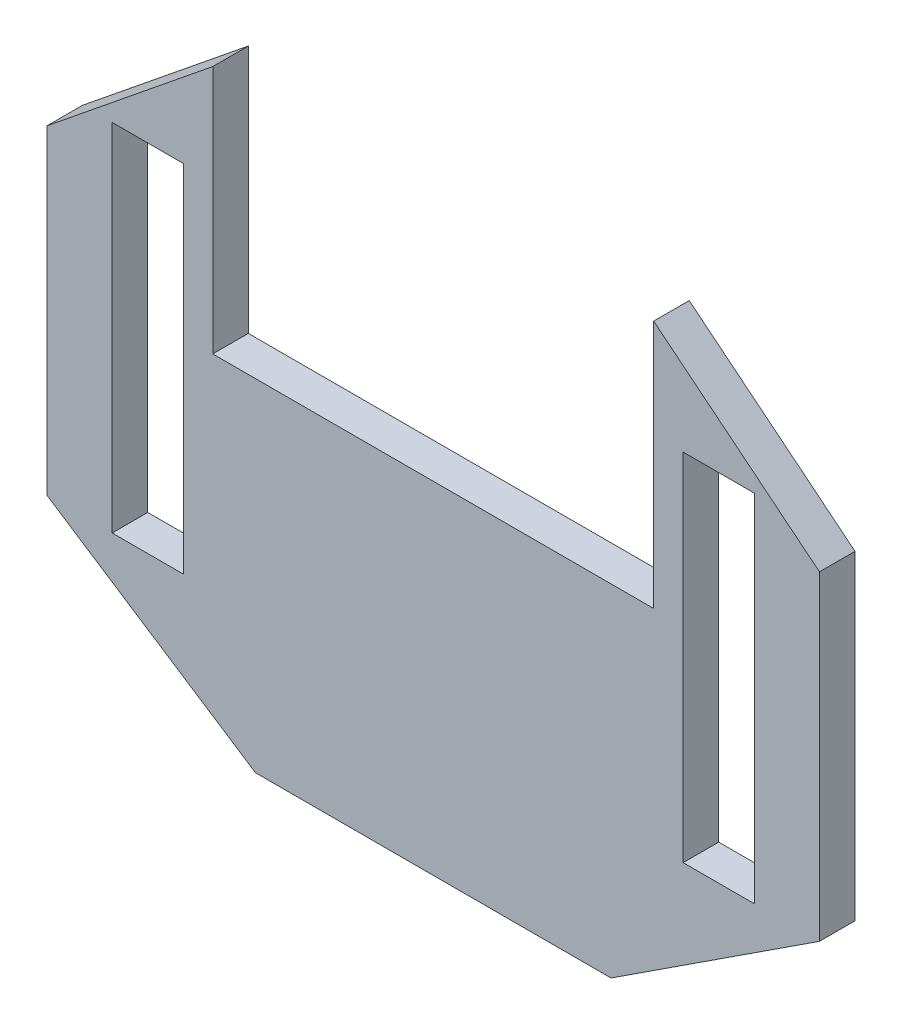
from build123d import *

# Parameters (mm, degrees)
ESQUISSE1_W        = 20
ESQUISSE1_H        = 100
BOSS_EXTRU_1_DEPTH = 10


with BuildPart() as part:
    # Esquisse1 → Boss.-Extru.1 (new body)
    with BuildSketch(Plane.XY):
        Polygon((62, 96), (-62, 96), (-62, 166), (-108.630230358, 128.242595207), (-108.630230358, 38.242595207), (-50, 0), (50, 0), (108.630230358, 38.242595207), (108.630230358, 128.242595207), (62, 166), align=None)
        with Locations((80.294345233, 88.242595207)):
            Rectangle(ESQUISSE1_W, ESQUISSE1_H, mode=Mode.SUBTRACT)
        with Locations((-80.294345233, 88.242595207)):
            Rectangle(ESQUISSE1_W, ESQUISSE1_H, mode=Mode.SUBTRACT)
    extrude(amount=BOSS_EXTRU_1_DEPTH)


solid = part.part
